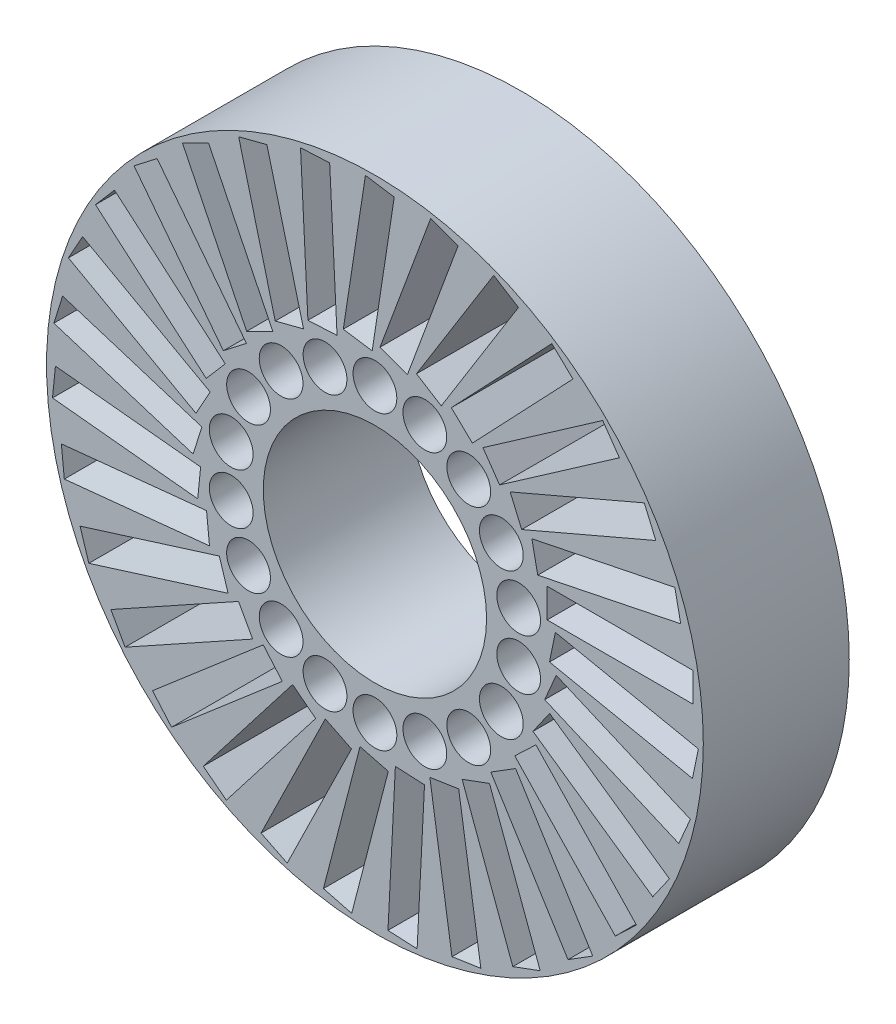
from build123d import *

# Parameters (mm, degrees)
SKETCH1_R           = 57.15
BOSS_EXTRUDE1_DEPTH = 25.4
SKETCH2_R           = 19.431
CUT_EXTRUDE1_DEPTH  = 35.56
SKETCH4_W           = 25.4
SKETCH4_H           = 5.08
CUT_EXTRUDE7_DEPTH  = 85.719566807
CIRPATTERN1_COUNT   = 31
SKETCH5_R           = 3.81
CUT_EXTRUDE8_DEPTH  = 85.719566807
CIRPATTERN3_COUNT   = 18


with BuildPart() as part:
    # Sketch1 → Boss-Extrude1 (new body)
    with BuildSketch(Plane.XY):
        Circle(SKETCH1_R)
    extrude(amount=BOSS_EXTRUDE1_DEPTH)

    # Sketch2 → Cut-Extrude1 (cut)
    with BuildSketch(Plane.XY):
        Circle(SKETCH2_R)
    extrude(amount=CUT_EXTRUDE1_DEPTH, mode=Mode.SUBTRACT)

    # Sketch4 → Cut-Extrude7 (cut, through all)
    with BuildSketch(Plane.XY):
        with Locations((42.672, 7.62)):
            Rectangle(SKETCH4_W, SKETCH4_H)
    cut_extrude7 = extrude(amount=CUT_EXTRUDE7_DEPTH, mode=Mode.SUBTRACT)

    # CirPattern1: Cut-Extrude7 ×31 about axis
    cirpattern1_axis = Axis((0, 0, 0), (0, 0, 1))
    for i in range(1, CIRPATTERN1_COUNT):
        add(cut_extrude7.rotate(cirpattern1_axis, i * 360 / CIRPATTERN1_COUNT), mode=Mode.SUBTRACT)

    # Sketch5 → Cut-Extrude8 (cut, through all)
    with BuildSketch(Plane.XY):
        with Locations((0, 25.4)):
            Circle(SKETCH5_R)
    cut_extrude8 = extrude(amount=CUT_EXTRUDE8_DEPTH, mode=Mode.SUBTRACT)

    # CirPattern3: Cut-Extrude8 ×18 about axis
    cirpattern3_axis = Axis((0, 0, 0), (0, 0, 1))
    for i in range(1, CIRPATTERN3_COUNT):
        add(cut_extrude8.rotate(cirpattern3_axis, i * 360 / CIRPATTERN3_COUNT), mode=Mode.SUBTRACT)


solid = part.part
